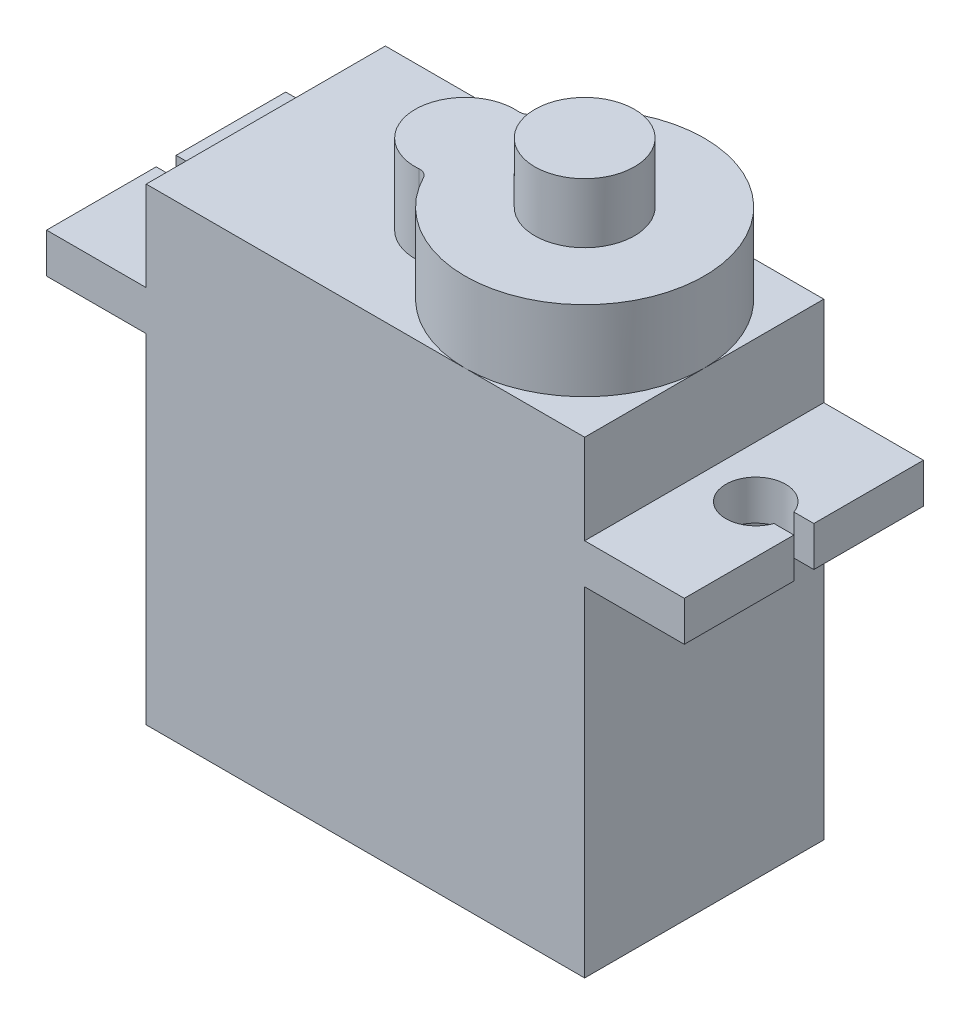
from build123d import *

# Parameters (mm, degrees)
SKETCH1_W           = 22
SKETCH1_H           = 12
BOSS_EXTRUDE1_DEPTH = 23.5
BOSS_EXTRUDE2_START = -17
BOSS_EXTRUDE2_DEPTH = 2
BOSS_EXTRUDE3_DEPTH = 4
SKETCH4_R           = 2.5
BOSS_EXTRUDE4_DEPTH = 3


with BuildPart() as part:
    # Sketch1 → Boss-Extrude1 (new body)
    with BuildSketch(Plane(origin=(0, 0, 0), x_dir=(1, 0, 0), z_dir=(0, 1, 0))):
        Rectangle(SKETCH1_W, SKETCH1_H)
    extrude(amount=BOSS_EXTRUDE1_DEPTH)

    # Sketch2 → Boss-Extrude2 (add)
    with BuildSketch(Plane.XZ.offset(BOSS_EXTRUDE2_START)):
        with BuildLine():
            Line((-11, 6), (-16, 6))
            Line((-16, 6), (-16, 0.5))
            Line((-16, 0.5), (-15, 0.5))
            ThreePointArc((-15, 0.5), (-13.33213347, 1.478397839), (-12.085786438, 0))
            ThreePointArc((-12.085786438, 0), (-13.33213347, -1.478397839), (-15, -0.5))
            Line((-15, -0.5), (-16, -0.5))
            Line((-16, -0.5), (-16, -6))
            Line((-16, -6), (-11, -6))
            Line((-11, -6), (-11, 6))
        make_face()
        with BuildLine():
            Line((16, 6), (11, 6))
            Line((11, 6), (11, -6))
            Line((11, -6), (16, -6))
            Line((16, -6), (16, -0.5))
            Line((16, -0.5), (15, -0.5))
            ThreePointArc((15, -0.5), (12.085786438, 0), (15, 0.5))
            Line((15, 0.5), (16, 0.5))
            Line((16, 0.5), (16, 6))
        make_face()
    extrude(amount=-BOSS_EXTRUDE2_DEPTH)

    # Sketch3 → Boss-Extrude3 (add)
    with BuildSketch(Plane(origin=(0, 23.5, 0), x_dir=(1, 0, 0), z_dir=(0, 1, 0))):
        with BuildLine():
            ThreePointArc((-0.326923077, -2.761139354), (11, 0), (-0.326923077, 2.761139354))
            ThreePointArc((-0.326923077, 2.761139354), (-0.527590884, 2.554389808), (-0.809027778, 2.49269525))
            ThreePointArc((-0.809027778, 2.49269525), (-3.5, 0), (-0.809027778, -2.49269525))
            ThreePointArc((-0.809027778, -2.49269525), (-0.527590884, -2.554389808), (-0.326923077, -2.761139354))
        make_face()
    extrude(amount=BOSS_EXTRUDE3_DEPTH)

    # Sketch4 → Boss-Extrude4 (add)
    with BuildSketch(Plane(origin=(0, 27.5, 0), x_dir=(1, 0, 0), z_dir=(0, 1, 0))):
        with Locations(Location((5, 0, 0), (0, 0, 90))):
            Circle(SKETCH4_R)
    extrude(amount=BOSS_EXTRUDE4_DEPTH)


solid = part.part
